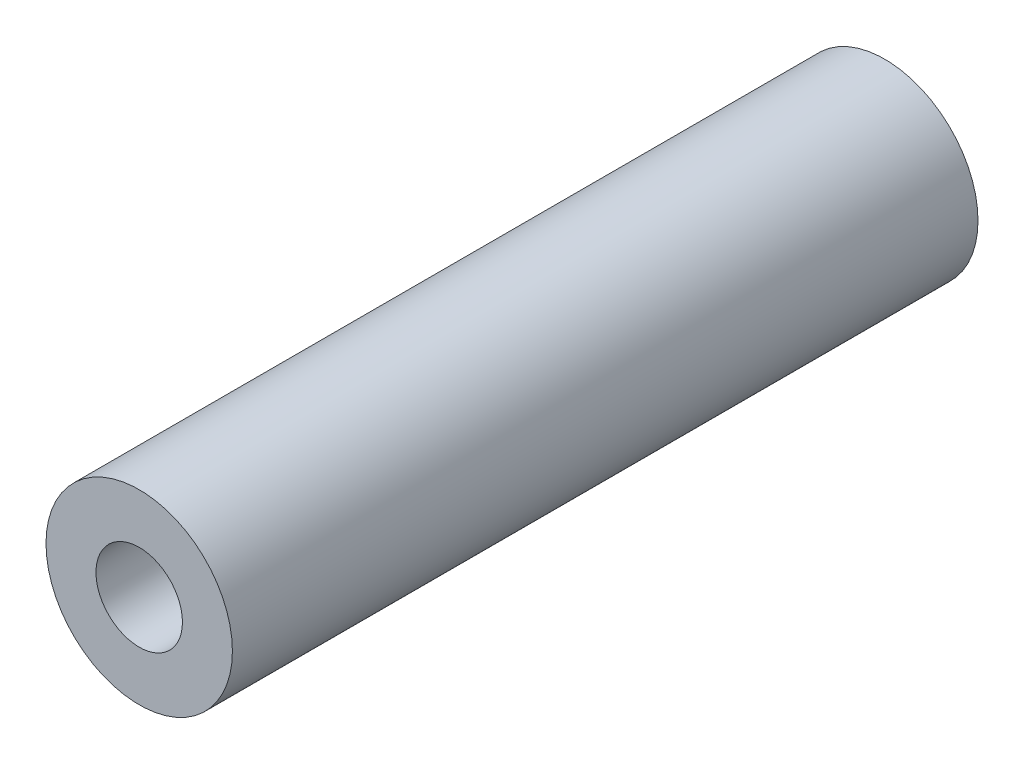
from build123d import *

# Parameters (mm, degrees)
SKETCH1_R             = 3.175
BOSS_EXTRUDE1_DEPTH   = 25.4
F_4_CLEARANCE_HOLE1_D = 2.9464


with BuildPart() as part:
    # Sketch1 → Boss-Extrude1 (new body)
    with BuildSketch(Plane.XY):
        Circle(SKETCH1_R)
    extrude(amount=BOSS_EXTRUDE1_DEPTH)

    # 4 Clearance Hole1 (through all)
    with Locations(Plane.XY.offset(25.4)):
        with Locations((0, 0)):
            Hole(F_4_CLEARANCE_HOLE1_D / 2)


solid = part.part
